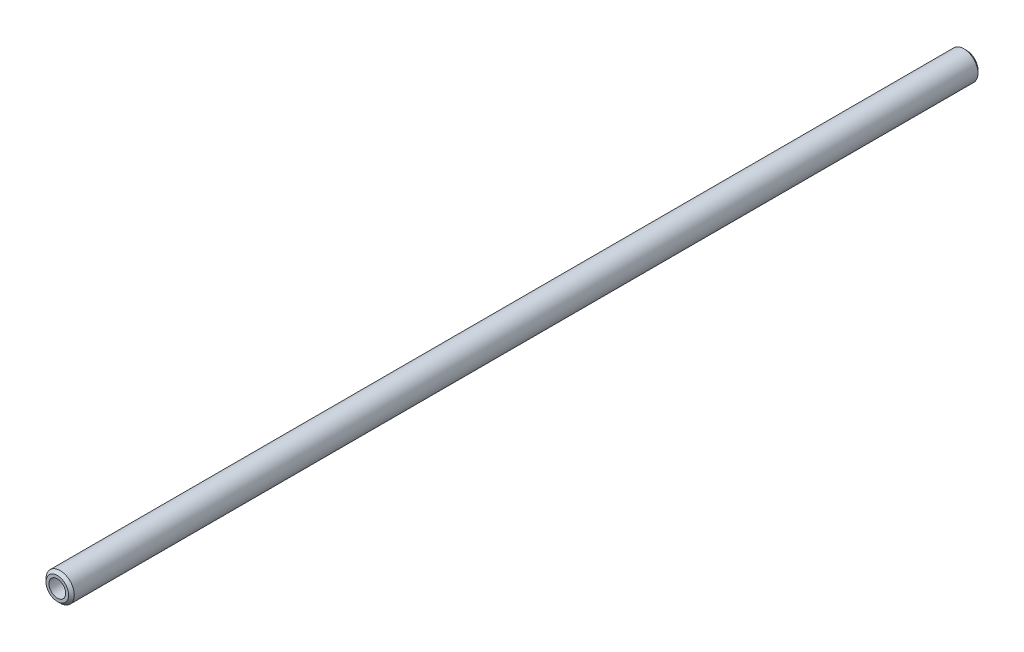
from build123d import *

# Parameters (mm, degrees)
SKETCH1_R      = 1.5
EXTRUDE1_DEPTH = 96.5
CHAMFER1_SIZE  = 0.3


with BuildPart() as part:
    # Sketch1 → Extrude1 (new body)
    with BuildSketch(Plane.XY):
        Circle(SKETCH1_R)
    extrude(amount=EXTRUDE1_DEPTH)

    # Chamfer1
    chamfer1_edges = [part.edges().sort_by_distance(p)[0] for p in [
        (-1.5, 0, 0),
        (-1.5, 0, 96.5),
    ]]
    chamfer(chamfer1_edges, length=CHAMFER1_SIZE)

    # Sketch5 → Tap Drill for _2-56 Tap1 (revolve, cut)
    with BuildSketch(Plane(origin=(0, 0, 96.5), x_dir=(0, -1, 0), z_dir=(1, 0, 0))):
        Polygon((0, 0), (0, 6.53416509), (0.889, 6), (0.889, 0), align=None)
    tap_drill_for_2_56_tap1 = revolve(axis=Axis((0, 0, 102.85), (0, 0, -1)), mode=Mode.SUBTRACT)

    # Mirror1: Tap Drill for _2-56 Tap1 across plane
    add(tap_drill_for_2_56_tap1.mirror(Plane.XY.offset(48.25)), mode=Mode.SUBTRACT)


solid = part.part
